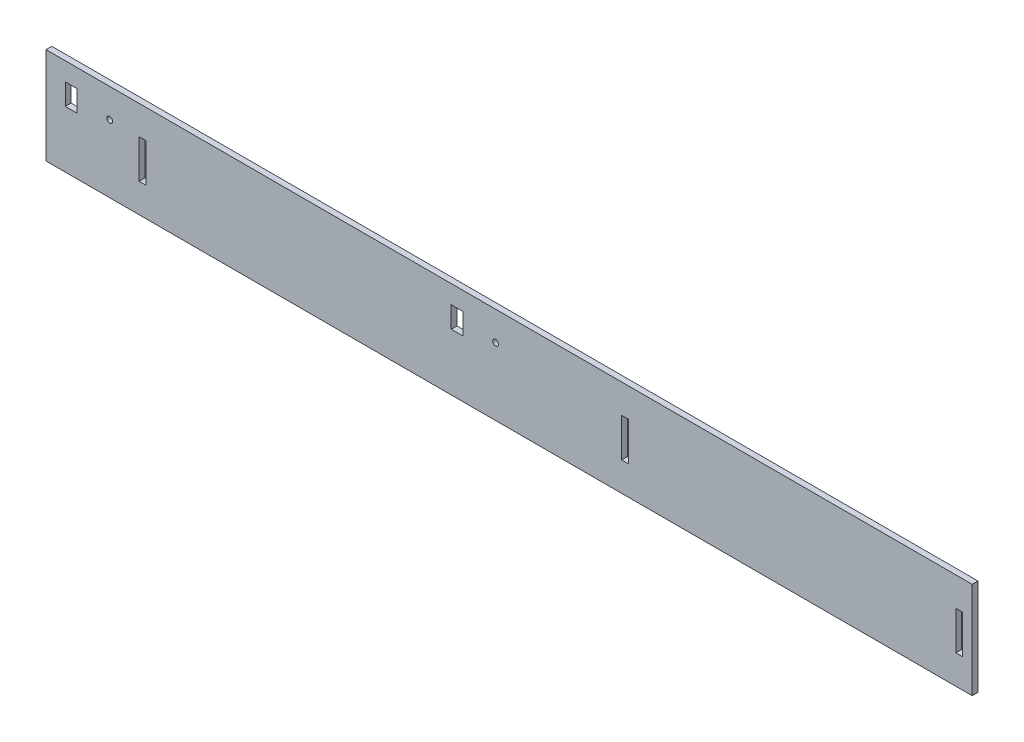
ISO-10303-21;
HEADER;
FILE_DESCRIPTION(('STEP AP214'),'2;1');
FILE_NAME('part.step','',(''),(''),'','','');
FILE_SCHEMA(('AUTOMOTIVE_DESIGN { 1 0 10303 214 1 1 1 1 }'));
ENDSEC;
DATA;
#1=APPLICATION_CONTEXT('core data for automotive mechanical design processes');
#2=APPLICATION_PROTOCOL_DEFINITION('international standard','automotive_design',2000,#1);
#3=PRODUCT_CONTEXT('',#1,'mechanical');
#4=PRODUCT('Part','Part','',(#3));
#5=PRODUCT_RELATED_PRODUCT_CATEGORY('part','',(#4));
#6=PRODUCT_DEFINITION_FORMATION('','',#4);
#7=PRODUCT_DEFINITION_CONTEXT('part definition',#1,'design');
#8=PRODUCT_DEFINITION('design','',#6,#7);
#9=PRODUCT_DEFINITION_SHAPE('','',#8);
#10=(LENGTH_UNIT() NAMED_UNIT(*) SI_UNIT(.MILLI.,.METRE.));
#11=(NAMED_UNIT(*) PLANE_ANGLE_UNIT() SI_UNIT($,.RADIAN.));
#12=(NAMED_UNIT(*) SI_UNIT($,.STERADIAN.) SOLID_ANGLE_UNIT());
#13=UNCERTAINTY_MEASURE_WITH_UNIT(LENGTH_MEASURE(1.E-05),#10,'distance_accuracy_value','');
#14=(GEOMETRIC_REPRESENTATION_CONTEXT(3) GLOBAL_UNCERTAINTY_ASSIGNED_CONTEXT((#13)) GLOBAL_UNIT_ASSIGNED_CONTEXT((#10,
#11,#12)) REPRESENTATION_CONTEXT('',''));
#15=CARTESIAN_POINT('',(0.,0.,0.));
#16=DIRECTION('',(0.,0.,1.));
#17=DIRECTION('',(1.,0.,0.));
#18=AXIS2_PLACEMENT_3D('',#15,#16,#17);
#19=CARTESIAN_POINT('',(0.,0.,3.));
#20=DIRECTION('',(0.,0.,1.));
#21=DIRECTION('',(1.,0.,0.));
#22=AXIS2_PLACEMENT_3D('',#19,#20,#21);
#23=PLANE('',#22);
#24=DIRECTION('',(1.,0.,0.));
#25=VECTOR('',#24,1.);
#26=CARTESIAN_POINT('',(210.,29.5,3.));
#27=LINE('',#26,#25);
#28=CARTESIAN_POINT('',(210.,29.5,3.));
#29=VERTEX_POINT('',#28);
#30=CARTESIAN_POINT('',(216.,29.5,3.));
#31=VERTEX_POINT('',#30);
#32=EDGE_CURVE('E269',#29,#31,#27,.T.);
#33=ORIENTED_EDGE('',*,*,#32,.F.);
#34=DIRECTION('',(0.,-1.,0.));
#35=VECTOR('',#34,1.);
#36=CARTESIAN_POINT('',(210.,40.5,3.));
#37=LINE('',#36,#35);
#38=CARTESIAN_POINT('',(210.,40.5,3.));
#39=VERTEX_POINT('',#38);
#40=EDGE_CURVE('E267',#39,#29,#37,.T.);
#41=ORIENTED_EDGE('',*,*,#40,.F.);
#42=DIRECTION('',(-1.,0.,0.));
#43=VECTOR('',#42,1.);
#44=CARTESIAN_POINT('',(210.,40.5,3.));
#45=LINE('',#44,#43);
#46=CARTESIAN_POINT('',(216.,40.5,3.));
#47=VERTEX_POINT('',#46);
#48=EDGE_CURVE('E275',#47,#39,#45,.T.);
#49=ORIENTED_EDGE('',*,*,#48,.F.);
#50=DIRECTION('',(0.,1.,0.));
#51=VECTOR('',#50,1.);
#52=CARTESIAN_POINT('',(216.,40.5,3.));
#53=LINE('',#52,#51);
#54=EDGE_CURVE('E272',#31,#47,#53,.T.);
#55=ORIENTED_EDGE('',*,*,#54,.F.);
#56=EDGE_LOOP('',(#33,#41,#49,#55));
#57=FACE_BOUND('',#56,.T.);
#58=DIRECTION('',(1.,0.,0.));
#59=VECTOR('',#58,1.);
#60=CARTESIAN_POINT('',(48.25,15.,3.));
#61=LINE('',#60,#59);
#62=CARTESIAN_POINT('',(48.25,15.,3.));
#63=VERTEX_POINT('',#62);
#64=CARTESIAN_POINT('',(51.75,15.,3.));
#65=VERTEX_POINT('',#64);
#66=EDGE_CURVE('E300',#63,#65,#61,.T.);
#67=ORIENTED_EDGE('',*,*,#66,.F.);
#68=DIRECTION('',(0.,-1.,0.));
#69=VECTOR('',#68,1.);
#70=CARTESIAN_POINT('',(48.25,35.,3.));
#71=LINE('',#70,#69);
#72=CARTESIAN_POINT('',(48.25,35.,3.));
#73=VERTEX_POINT('',#72);
#74=EDGE_CURVE('E298',#73,#63,#71,.T.);
#75=ORIENTED_EDGE('',*,*,#74,.F.);
#76=DIRECTION('',(-1.,0.,0.));
#77=VECTOR('',#76,1.);
#78=CARTESIAN_POINT('',(48.25,35.,3.));
#79=LINE('',#78,#77);
#80=CARTESIAN_POINT('',(51.75,35.,3.));
#81=VERTEX_POINT('',#80);
#82=EDGE_CURVE('E306',#81,#73,#79,.T.);
#83=ORIENTED_EDGE('',*,*,#82,.F.);
#84=DIRECTION('',(0.,1.,0.));
#85=VECTOR('',#84,1.);
#86=CARTESIAN_POINT('',(51.75,35.,3.));
#87=LINE('',#86,#85);
#88=EDGE_CURVE('E303',#65,#81,#87,.T.);
#89=ORIENTED_EDGE('',*,*,#88,.F.);
#90=EDGE_LOOP('',(#67,#75,#83,#89));
#91=FACE_BOUND('',#90,.T.);
#92=CARTESIAN_POINT('',(33.,35.,3.));
#93=DIRECTION('',(0.,0.,1.));
#94=DIRECTION('',(1.,0.,0.));
#95=AXIS2_PLACEMENT_3D('',#92,#93,#94);
#96=CIRCLE('',#95,1.5);
#97=CARTESIAN_POINT('',(34.5,35.,3.));
#98=VERTEX_POINT('',#97);
#99=EDGE_CURVE('E329',#98,#98,#96,.T.);
#100=ORIENTED_EDGE('',*,*,#99,.F.);
#101=EDGE_LOOP('',(#100));
#102=FACE_BOUND('',#101,.T.);
#103=DIRECTION('',(0.,-1.,0.));
#104=VECTOR('',#103,1.);
#105=CARTESIAN_POINT('',(0.,50.,3.));
#106=LINE('',#105,#104);
#107=CARTESIAN_POINT('',(0.,50.,3.));
#108=VERTEX_POINT('',#107);
#109=CARTESIAN_POINT('',(0.,0.,3.));
#110=VERTEX_POINT('',#109);
#111=EDGE_CURVE('E366',#108,#110,#106,.T.);
#112=ORIENTED_EDGE('',*,*,#111,.T.);
#113=DIRECTION('',(1.,0.,0.));
#114=VECTOR('',#113,1.);
#115=CARTESIAN_POINT('',(0.,0.,3.));
#116=LINE('',#115,#114);
#117=CARTESIAN_POINT('',(480.,0.,3.));
#118=VERTEX_POINT('',#117);
#119=EDGE_CURVE('E369',#110,#118,#116,.T.);
#120=ORIENTED_EDGE('',*,*,#119,.T.);
#121=DIRECTION('',(0.,1.,0.));
#122=VECTOR('',#121,1.);
#123=CARTESIAN_POINT('',(480.,50.,3.));
#124=LINE('',#123,#122);
#125=CARTESIAN_POINT('',(480.,50.,3.));
#126=VERTEX_POINT('',#125);
#127=EDGE_CURVE('E372',#118,#126,#124,.T.);
#128=ORIENTED_EDGE('',*,*,#127,.T.);
#129=DIRECTION('',(-1.,0.,0.));
#130=VECTOR('',#129,1.);
#131=CARTESIAN_POINT('',(0.,50.,3.));
#132=LINE('',#131,#130);
#133=EDGE_CURVE('E374',#126,#108,#132,.T.);
#134=ORIENTED_EDGE('',*,*,#133,.T.);
#135=EDGE_LOOP('',(#112,#120,#128,#134));
#136=FACE_BOUND('',#135,.T.);
#137=DIRECTION('',(1.,0.,0.));
#138=VECTOR('',#137,1.);
#139=CARTESIAN_POINT('',(10.,29.5,3.));
#140=LINE('',#139,#138);
#141=CARTESIAN_POINT('',(10.,29.5,3.));
#142=VERTEX_POINT('',#141);
#143=CARTESIAN_POINT('',(16.,29.5,3.));
#144=VERTEX_POINT('',#143);
#145=EDGE_CURVE('E337',#142,#144,#140,.T.);
#146=ORIENTED_EDGE('',*,*,#145,.F.);
#147=DIRECTION('',(0.,-1.,0.));
#148=VECTOR('',#147,1.);
#149=CARTESIAN_POINT('',(10.,40.5,3.));
#150=LINE('',#149,#148);
#151=CARTESIAN_POINT('',(10.,40.5,3.));
#152=VERTEX_POINT('',#151);
#153=EDGE_CURVE('E335',#152,#142,#150,.T.);
#154=ORIENTED_EDGE('',*,*,#153,.F.);
#155=DIRECTION('',(-1.,0.,0.));
#156=VECTOR('',#155,1.);
#157=CARTESIAN_POINT('',(10.,40.5,3.));
#158=LINE('',#157,#156);
#159=CARTESIAN_POINT('',(16.,40.5,3.));
#160=VERTEX_POINT('',#159);
#161=EDGE_CURVE('E343',#160,#152,#158,.T.);
#162=ORIENTED_EDGE('',*,*,#161,.F.);
#163=DIRECTION('',(0.,1.,0.));
#164=VECTOR('',#163,1.);
#165=CARTESIAN_POINT('',(16.,40.5,3.));
#166=LINE('',#165,#164);
#167=EDGE_CURVE('E340',#144,#160,#166,.T.);
#168=ORIENTED_EDGE('',*,*,#167,.F.);
#169=EDGE_LOOP('',(#146,#154,#162,#168));
#170=FACE_BOUND('',#169,.T.);
#171=CARTESIAN_POINT('',(233.,35.,3.));
#172=DIRECTION('',(0.,0.,1.));
#173=DIRECTION('',(1.,0.,0.));
#174=AXIS2_PLACEMENT_3D('',#171,#172,#173);
#175=CIRCLE('',#174,1.5);
#176=CARTESIAN_POINT('',(234.5,35.,3.));
#177=VERTEX_POINT('',#176);
#178=EDGE_CURVE('E261',#177,#177,#175,.T.);
#179=ORIENTED_EDGE('',*,*,#178,.F.);
#180=EDGE_LOOP('',(#179));
#181=FACE_BOUND('',#180,.T.);
#182=DIRECTION('',(1.,0.,0.));
#183=VECTOR('',#182,1.);
#184=CARTESIAN_POINT('',(298.25,15.,3.));
#185=LINE('',#184,#183);
#186=CARTESIAN_POINT('',(298.25,15.,3.));
#187=VERTEX_POINT('',#186);
#188=CARTESIAN_POINT('',(301.75,15.,3.));
#189=VERTEX_POINT('',#188);
#190=EDGE_CURVE('E232',#187,#189,#185,.T.);
#191=ORIENTED_EDGE('',*,*,#190,.F.);
#192=DIRECTION('',(0.,-1.,0.));
#193=VECTOR('',#192,1.);
#194=CARTESIAN_POINT('',(298.25,35.,3.));
#195=LINE('',#194,#193);
#196=CARTESIAN_POINT('',(298.25,35.,3.));
#197=VERTEX_POINT('',#196);
#198=EDGE_CURVE('E230',#197,#187,#195,.T.);
#199=ORIENTED_EDGE('',*,*,#198,.F.);
#200=DIRECTION('',(-1.,0.,0.));
#201=VECTOR('',#200,1.);
#202=CARTESIAN_POINT('',(298.25,35.,3.));
#203=LINE('',#202,#201);
#204=CARTESIAN_POINT('',(301.75,35.,3.));
#205=VERTEX_POINT('',#204);
#206=EDGE_CURVE('E238',#205,#197,#203,.T.);
#207=ORIENTED_EDGE('',*,*,#206,.F.);
#208=DIRECTION('',(0.,1.,0.));
#209=VECTOR('',#208,1.);
#210=CARTESIAN_POINT('',(301.75,35.,3.));
#211=LINE('',#210,#209);
#212=EDGE_CURVE('E235',#189,#205,#211,.T.);
#213=ORIENTED_EDGE('',*,*,#212,.F.);
#214=EDGE_LOOP('',(#191,#199,#207,#213));
#215=FACE_BOUND('',#214,.T.);
#216=DIRECTION('',(1.,0.,0.));
#217=VECTOR('',#216,1.);
#218=CARTESIAN_POINT('',(471.5,15.,3.));
#219=LINE('',#218,#217);
#220=CARTESIAN_POINT('',(471.5,15.,3.));
#221=VERTEX_POINT('',#220);
#222=CARTESIAN_POINT('',(475.,15.,3.));
#223=VERTEX_POINT('',#222);
#224=EDGE_CURVE('E202',#221,#223,#219,.T.);
#225=ORIENTED_EDGE('',*,*,#224,.F.);
#226=DIRECTION('',(0.,-1.,0.));
#227=VECTOR('',#226,1.);
#228=CARTESIAN_POINT('',(471.5,35.,3.));
#229=LINE('',#228,#227);
#230=CARTESIAN_POINT('',(471.5,35.,3.));
#231=VERTEX_POINT('',#230);
#232=EDGE_CURVE('E194',#231,#221,#229,.T.);
#233=ORIENTED_EDGE('',*,*,#232,.F.);
#234=DIRECTION('',(-1.,0.,0.));
#235=VECTOR('',#234,1.);
#236=CARTESIAN_POINT('',(471.5,35.,3.));
#237=LINE('',#236,#235);
#238=CARTESIAN_POINT('',(475.,35.,3.));
#239=VERTEX_POINT('',#238);
#240=EDGE_CURVE('E216',#239,#231,#237,.T.);
#241=ORIENTED_EDGE('',*,*,#240,.F.);
#242=DIRECTION('',(0.,1.,0.));
#243=VECTOR('',#242,1.);
#244=CARTESIAN_POINT('',(475.,35.,3.));
#245=LINE('',#244,#243);
#246=EDGE_CURVE('E214',#223,#239,#245,.T.);
#247=ORIENTED_EDGE('',*,*,#246,.F.);
#248=EDGE_LOOP('',(#225,#233,#241,#247));
#249=FACE_BOUND('',#248,.T.);
#250=ADVANCED_FACE('F33',(#57,#91,#102,#136,#170,#181,#215,#249),#23,.T.);
#251=CARTESIAN_POINT('',(0.,0.,0.));
#252=DIRECTION('',(0.,0.,1.));
#253=DIRECTION('',(1.,0.,0.));
#254=AXIS2_PLACEMENT_3D('',#251,#252,#253);
#255=PLANE('',#254);
#256=DIRECTION('',(0.,-1.,0.));
#257=VECTOR('',#256,1.);
#258=CARTESIAN_POINT('',(298.25,35.,0.));
#259=LINE('',#258,#257);
#260=CARTESIAN_POINT('',(298.25,35.,0.));
#261=VERTEX_POINT('',#260);
#262=CARTESIAN_POINT('',(298.25,15.,0.));
#263=VERTEX_POINT('',#262);
#264=EDGE_CURVE('E210',#261,#263,#259,.T.);
#265=ORIENTED_EDGE('',*,*,#264,.T.);
#266=DIRECTION('',(1.,0.,0.));
#267=VECTOR('',#266,1.);
#268=CARTESIAN_POINT('',(298.25,15.,0.));
#269=LINE('',#268,#267);
#270=CARTESIAN_POINT('',(301.75,15.,0.));
#271=VERTEX_POINT('',#270);
#272=EDGE_CURVE('E243',#263,#271,#269,.T.);
#273=ORIENTED_EDGE('',*,*,#272,.T.);
#274=DIRECTION('',(0.,1.,0.));
#275=VECTOR('',#274,1.);
#276=CARTESIAN_POINT('',(301.75,35.,0.));
#277=LINE('',#276,#275);
#278=CARTESIAN_POINT('',(301.75,35.,0.));
#279=VERTEX_POINT('',#278);
#280=EDGE_CURVE('E246',#271,#279,#277,.T.);
#281=ORIENTED_EDGE('',*,*,#280,.T.);
#282=DIRECTION('',(-1.,0.,0.));
#283=VECTOR('',#282,1.);
#284=CARTESIAN_POINT('',(298.25,35.,0.));
#285=LINE('',#284,#283);
#286=EDGE_CURVE('E233',#279,#261,#285,.T.);
#287=ORIENTED_EDGE('',*,*,#286,.T.);
#288=EDGE_LOOP('',(#265,#273,#281,#287));
#289=FACE_BOUND('',#288,.T.);
#290=DIRECTION('',(0.,-1.,0.));
#291=VECTOR('',#290,1.);
#292=CARTESIAN_POINT('',(48.25,35.,0.));
#293=LINE('',#292,#291);
#294=CARTESIAN_POINT('',(48.25,35.,0.));
#295=VERTEX_POINT('',#294);
#296=CARTESIAN_POINT('',(48.25,15.,0.));
#297=VERTEX_POINT('',#296);
#298=EDGE_CURVE('E297',#295,#297,#293,.T.);
#299=ORIENTED_EDGE('',*,*,#298,.T.);
#300=DIRECTION('',(1.,0.,0.));
#301=VECTOR('',#300,1.);
#302=CARTESIAN_POINT('',(48.25,15.,0.));
#303=LINE('',#302,#301);
#304=CARTESIAN_POINT('',(51.75,15.,0.));
#305=VERTEX_POINT('',#304);
#306=EDGE_CURVE('E311',#297,#305,#303,.T.);
#307=ORIENTED_EDGE('',*,*,#306,.T.);
#308=DIRECTION('',(0.,1.,0.));
#309=VECTOR('',#308,1.);
#310=CARTESIAN_POINT('',(51.75,35.,0.));
#311=LINE('',#310,#309);
#312=CARTESIAN_POINT('',(51.75,35.,0.));
#313=VERTEX_POINT('',#312);
#314=EDGE_CURVE('E314',#305,#313,#311,.T.);
#315=ORIENTED_EDGE('',*,*,#314,.T.);
#316=DIRECTION('',(-1.,0.,0.));
#317=VECTOR('',#316,1.);
#318=CARTESIAN_POINT('',(48.25,35.,0.));
#319=LINE('',#318,#317);
#320=EDGE_CURVE('E301',#313,#295,#319,.T.);
#321=ORIENTED_EDGE('',*,*,#320,.T.);
#322=EDGE_LOOP('',(#299,#307,#315,#321));
#323=FACE_BOUND('',#322,.T.);
#324=DIRECTION('',(0.,-1.,0.));
#325=VECTOR('',#324,1.);
#326=CARTESIAN_POINT('',(0.,50.,0.));
#327=LINE('',#326,#325);
#328=CARTESIAN_POINT('',(0.,50.,0.));
#329=VERTEX_POINT('',#328);
#330=CARTESIAN_POINT('',(0.,0.,0.));
#331=VERTEX_POINT('',#330);
#332=EDGE_CURVE('E365',#329,#331,#327,.T.);
#333=ORIENTED_EDGE('',*,*,#332,.F.);
#334=DIRECTION('',(-1.,0.,0.));
#335=VECTOR('',#334,1.);
#336=CARTESIAN_POINT('',(0.,50.,0.));
#337=LINE('',#336,#335);
#338=CARTESIAN_POINT('',(480.,50.,0.));
#339=VERTEX_POINT('',#338);
#340=EDGE_CURVE('E370',#339,#329,#337,.T.);
#341=ORIENTED_EDGE('',*,*,#340,.F.);
#342=DIRECTION('',(0.,1.,0.));
#343=VECTOR('',#342,1.);
#344=CARTESIAN_POINT('',(480.,50.,0.));
#345=LINE('',#344,#343);
#346=CARTESIAN_POINT('',(480.,0.,0.));
#347=VERTEX_POINT('',#346);
#348=EDGE_CURVE('E381',#347,#339,#345,.T.);
#349=ORIENTED_EDGE('',*,*,#348,.F.);
#350=DIRECTION('',(1.,0.,0.));
#351=VECTOR('',#350,1.);
#352=CARTESIAN_POINT('',(0.,0.,0.));
#353=LINE('',#352,#351);
#354=EDGE_CURVE('E379',#331,#347,#353,.T.);
#355=ORIENTED_EDGE('',*,*,#354,.F.);
#356=EDGE_LOOP('',(#333,#341,#349,#355));
#357=FACE_BOUND('',#356,.T.);
#358=DIRECTION('',(0.,-1.,0.));
#359=VECTOR('',#358,1.);
#360=CARTESIAN_POINT('',(10.,40.5,0.));
#361=LINE('',#360,#359);
#362=CARTESIAN_POINT('',(10.,40.5,0.));
#363=VERTEX_POINT('',#362);
#364=CARTESIAN_POINT('',(10.,29.5,0.));
#365=VERTEX_POINT('',#364);
#366=EDGE_CURVE('E332',#363,#365,#361,.T.);
#367=ORIENTED_EDGE('',*,*,#366,.T.);
#368=DIRECTION('',(1.,0.,0.));
#369=VECTOR('',#368,1.);
#370=CARTESIAN_POINT('',(10.,29.5,0.));
#371=LINE('',#370,#369);
#372=CARTESIAN_POINT('',(16.,29.5,0.));
#373=VERTEX_POINT('',#372);
#374=EDGE_CURVE('E348',#365,#373,#371,.T.);
#375=ORIENTED_EDGE('',*,*,#374,.T.);
#376=DIRECTION('',(0.,1.,0.));
#377=VECTOR('',#376,1.);
#378=CARTESIAN_POINT('',(16.,40.5,0.));
#379=LINE('',#378,#377);
#380=CARTESIAN_POINT('',(16.,40.5,0.));
#381=VERTEX_POINT('',#380);
#382=EDGE_CURVE('E351',#373,#381,#379,.T.);
#383=ORIENTED_EDGE('',*,*,#382,.T.);
#384=DIRECTION('',(-1.,0.,0.));
#385=VECTOR('',#384,1.);
#386=CARTESIAN_POINT('',(10.,40.5,0.));
#387=LINE('',#386,#385);
#388=EDGE_CURVE('E338',#381,#363,#387,.T.);
#389=ORIENTED_EDGE('',*,*,#388,.T.);
#390=EDGE_LOOP('',(#367,#375,#383,#389));
#391=FACE_BOUND('',#390,.T.);
#392=CARTESIAN_POINT('',(33.,35.,0.));
#393=DIRECTION('',(0.,0.,1.));
#394=DIRECTION('',(1.,0.,0.));
#395=AXIS2_PLACEMENT_3D('',#392,#393,#394);
#396=CIRCLE('',#395,1.5);
#397=CARTESIAN_POINT('',(34.5,35.,0.));
#398=VERTEX_POINT('',#397);
#399=EDGE_CURVE('E328',#398,#398,#396,.T.);
#400=ORIENTED_EDGE('',*,*,#399,.T.);
#401=EDGE_LOOP('',(#400));
#402=FACE_BOUND('',#401,.T.);
#403=DIRECTION('',(0.,-1.,0.));
#404=VECTOR('',#403,1.);
#405=CARTESIAN_POINT('',(210.,40.5,0.));
#406=LINE('',#405,#404);
#407=CARTESIAN_POINT('',(210.,40.5,0.));
#408=VERTEX_POINT('',#407);
#409=CARTESIAN_POINT('',(210.,29.5,0.));
#410=VERTEX_POINT('',#409);
#411=EDGE_CURVE('E264',#408,#410,#406,.T.);
#412=ORIENTED_EDGE('',*,*,#411,.T.);
#413=DIRECTION('',(1.,0.,0.));
#414=VECTOR('',#413,1.);
#415=CARTESIAN_POINT('',(210.,29.5,0.));
#416=LINE('',#415,#414);
#417=CARTESIAN_POINT('',(216.,29.5,0.));
#418=VERTEX_POINT('',#417);
#419=EDGE_CURVE('E280',#410,#418,#416,.T.);
#420=ORIENTED_EDGE('',*,*,#419,.T.);
#421=DIRECTION('',(0.,1.,0.));
#422=VECTOR('',#421,1.);
#423=CARTESIAN_POINT('',(216.,40.5,0.));
#424=LINE('',#423,#422);
#425=CARTESIAN_POINT('',(216.,40.5,0.));
#426=VERTEX_POINT('',#425);
#427=EDGE_CURVE('E283',#418,#426,#424,.T.);
#428=ORIENTED_EDGE('',*,*,#427,.T.);
#429=DIRECTION('',(-1.,0.,0.));
#430=VECTOR('',#429,1.);
#431=CARTESIAN_POINT('',(210.,40.5,0.));
#432=LINE('',#431,#430);
#433=EDGE_CURVE('E270',#426,#408,#432,.T.);
#434=ORIENTED_EDGE('',*,*,#433,.T.);
#435=EDGE_LOOP('',(#412,#420,#428,#434));
#436=FACE_BOUND('',#435,.T.);
#437=CARTESIAN_POINT('',(233.,35.,0.));
#438=DIRECTION('',(0.,0.,1.));
#439=DIRECTION('',(1.,0.,0.));
#440=AXIS2_PLACEMENT_3D('',#437,#438,#439);
#441=CIRCLE('',#440,1.5);
#442=CARTESIAN_POINT('',(234.5,35.,0.));
#443=VERTEX_POINT('',#442);
#444=EDGE_CURVE('E260',#443,#443,#441,.T.);
#445=ORIENTED_EDGE('',*,*,#444,.T.);
#446=EDGE_LOOP('',(#445));
#447=FACE_BOUND('',#446,.T.);
#448=DIRECTION('',(0.,-1.,0.));
#449=VECTOR('',#448,1.);
#450=CARTESIAN_POINT('',(471.5,35.,0.));
#451=LINE('',#450,#449);
#452=CARTESIAN_POINT('',(471.5,35.,0.));
#453=VERTEX_POINT('',#452);
#454=CARTESIAN_POINT('',(471.5,15.,0.));
#455=VERTEX_POINT('',#454);
#456=EDGE_CURVE('E56',#453,#455,#451,.T.);
#457=ORIENTED_EDGE('',*,*,#456,.T.);
#458=DIRECTION('',(1.,0.,0.));
#459=VECTOR('',#458,1.);
#460=CARTESIAN_POINT('',(471.5,15.,0.));
#461=LINE('',#460,#459);
#462=CARTESIAN_POINT('',(475.,15.,0.));
#463=VERTEX_POINT('',#462);
#464=EDGE_CURVE('E209',#455,#463,#461,.T.);
#465=ORIENTED_EDGE('',*,*,#464,.T.);
#466=DIRECTION('',(0.,1.,0.));
#467=VECTOR('',#466,1.);
#468=CARTESIAN_POINT('',(475.,35.,0.));
#469=LINE('',#468,#467);
#470=CARTESIAN_POINT('',(475.,35.,0.));
#471=VERTEX_POINT('',#470);
#472=EDGE_CURVE('E222',#463,#471,#469,.T.);
#473=ORIENTED_EDGE('',*,*,#472,.T.);
#474=DIRECTION('',(-1.,0.,0.));
#475=VECTOR('',#474,1.);
#476=CARTESIAN_POINT('',(471.5,35.,0.));
#477=LINE('',#476,#475);
#478=EDGE_CURVE('E203',#471,#453,#477,.T.);
#479=ORIENTED_EDGE('',*,*,#478,.T.);
#480=EDGE_LOOP('',(#457,#465,#473,#479));
#481=FACE_BOUND('',#480,.T.);
#482=ADVANCED_FACE('F399',(#289,#323,#357,#391,#402,#436,#447,#481),#255,.F.);
#483=CARTESIAN_POINT('',(0.,50.,3.));
#484=DIRECTION('',(1.,0.,0.));
#485=DIRECTION('',(0.,0.,-1.));
#486=AXIS2_PLACEMENT_3D('',#483,#484,#485);
#487=PLANE('',#486);
#488=ORIENTED_EDGE('',*,*,#332,.T.);
#489=DIRECTION('',(0.,0.,-1.));
#490=VECTOR('',#489,1.);
#491=CARTESIAN_POINT('',(0.,0.,3.));
#492=LINE('',#491,#490);
#493=EDGE_CURVE('E11',#110,#331,#492,.T.);
#494=ORIENTED_EDGE('',*,*,#493,.F.);
#495=ORIENTED_EDGE('',*,*,#111,.F.);
#496=DIRECTION('',(0.,0.,-1.));
#497=VECTOR('',#496,1.);
#498=CARTESIAN_POINT('',(0.,50.,3.));
#499=LINE('',#498,#497);
#500=EDGE_CURVE('E376',#108,#329,#499,.T.);
#501=ORIENTED_EDGE('',*,*,#500,.T.);
#502=EDGE_LOOP('',(#488,#494,#495,#501));
#503=FACE_BOUND('',#502,.T.);
#504=ADVANCED_FACE('F35',(#503),#487,.F.);
#505=CARTESIAN_POINT('',(0.,0.,3.));
#506=DIRECTION('',(0.,1.,0.));
#507=DIRECTION('',(0.,0.,1.));
#508=AXIS2_PLACEMENT_3D('',#505,#506,#507);
#509=PLANE('',#508);
#510=ORIENTED_EDGE('',*,*,#354,.T.);
#511=DIRECTION('',(0.,0.,-1.));
#512=VECTOR('',#511,1.);
#513=CARTESIAN_POINT('',(480.,0.,3.));
#514=LINE('',#513,#512);
#515=EDGE_CURVE('E41',#118,#347,#514,.T.);
#516=ORIENTED_EDGE('',*,*,#515,.F.);
#517=ORIENTED_EDGE('',*,*,#119,.F.);
#518=ORIENTED_EDGE('',*,*,#493,.T.);
#519=EDGE_LOOP('',(#510,#516,#517,#518));
#520=FACE_BOUND('',#519,.T.);
#521=ADVANCED_FACE('F410',(#520),#509,.F.);
#522=CARTESIAN_POINT('',(480.,50.,3.));
#523=DIRECTION('',(-1.,0.,0.));
#524=DIRECTION('',(0.,0.,1.));
#525=AXIS2_PLACEMENT_3D('',#522,#523,#524);
#526=PLANE('',#525);
#527=ORIENTED_EDGE('',*,*,#348,.T.);
#528=DIRECTION('',(0.,0.,-1.));
#529=VECTOR('',#528,1.);
#530=CARTESIAN_POINT('',(480.,50.,3.));
#531=LINE('',#530,#529);
#532=EDGE_CURVE('E386',#126,#339,#531,.T.);
#533=ORIENTED_EDGE('',*,*,#532,.F.);
#534=ORIENTED_EDGE('',*,*,#127,.F.);
#535=ORIENTED_EDGE('',*,*,#515,.T.);
#536=EDGE_LOOP('',(#527,#533,#534,#535));
#537=FACE_BOUND('',#536,.T.);
#538=ADVANCED_FACE('F393',(#537),#526,.F.);
#539=CARTESIAN_POINT('',(0.,50.,3.));
#540=DIRECTION('',(0.,-1.,0.));
#541=DIRECTION('',(1.,0.,0.));
#542=AXIS2_PLACEMENT_3D('',#539,#540,#541);
#543=PLANE('',#542);
#544=ORIENTED_EDGE('',*,*,#340,.T.);
#545=ORIENTED_EDGE('',*,*,#500,.F.);
#546=ORIENTED_EDGE('',*,*,#133,.F.);
#547=ORIENTED_EDGE('',*,*,#532,.T.);
#548=EDGE_LOOP('',(#544,#545,#546,#547));
#549=FACE_BOUND('',#548,.T.);
#550=ADVANCED_FACE('F403',(#549),#543,.F.);
#551=CARTESIAN_POINT('',(10.,40.5,3.));
#552=DIRECTION('',(1.,0.,0.));
#553=DIRECTION('',(0.,0.,-1.));
#554=AXIS2_PLACEMENT_3D('',#551,#552,#553);
#555=PLANE('',#554);
#556=ORIENTED_EDGE('',*,*,#366,.F.);
#557=DIRECTION('',(0.,0.,-1.));
#558=VECTOR('',#557,1.);
#559=CARTESIAN_POINT('',(10.,40.5,3.));
#560=LINE('',#559,#558);
#561=EDGE_CURVE('E345',#152,#363,#560,.T.);
#562=ORIENTED_EDGE('',*,*,#561,.F.);
#563=ORIENTED_EDGE('',*,*,#153,.T.);
#564=DIRECTION('',(0.,0.,-1.));
#565=VECTOR('',#564,1.);
#566=CARTESIAN_POINT('',(10.,29.5,3.));
#567=LINE('',#566,#565);
#568=EDGE_CURVE('E362',#142,#365,#567,.T.);
#569=ORIENTED_EDGE('',*,*,#568,.T.);
#570=EDGE_LOOP('',(#556,#562,#563,#569));
#571=FACE_BOUND('',#570,.T.);
#572=ADVANCED_FACE('F428',(#571),#555,.T.);
#573=CARTESIAN_POINT('',(10.,29.5,3.));
#574=DIRECTION('',(0.,1.,0.));
#575=DIRECTION('',(0.,0.,1.));
#576=AXIS2_PLACEMENT_3D('',#573,#574,#575);
#577=PLANE('',#576);
#578=ORIENTED_EDGE('',*,*,#374,.F.);
#579=ORIENTED_EDGE('',*,*,#568,.F.);
#580=ORIENTED_EDGE('',*,*,#145,.T.);
#581=DIRECTION('',(0.,0.,-1.));
#582=VECTOR('',#581,1.);
#583=CARTESIAN_POINT('',(16.,29.5,3.));
#584=LINE('',#583,#582);
#585=EDGE_CURVE('E360',#144,#373,#584,.T.);
#586=ORIENTED_EDGE('',*,*,#585,.T.);
#587=EDGE_LOOP('',(#578,#579,#580,#586));
#588=FACE_BOUND('',#587,.T.);
#589=ADVANCED_FACE('F435',(#588),#577,.T.);
#590=CARTESIAN_POINT('',(16.,40.5,3.));
#591=DIRECTION('',(-1.,0.,0.));
#592=DIRECTION('',(0.,0.,1.));
#593=AXIS2_PLACEMENT_3D('',#590,#591,#592);
#594=PLANE('',#593);
#595=ORIENTED_EDGE('',*,*,#382,.F.);
#596=ORIENTED_EDGE('',*,*,#585,.F.);
#597=ORIENTED_EDGE('',*,*,#167,.T.);
#598=DIRECTION('',(0.,0.,-1.));
#599=VECTOR('',#598,1.);
#600=CARTESIAN_POINT('',(16.,40.5,3.));
#601=LINE('',#600,#599);
#602=EDGE_CURVE('E358',#160,#381,#601,.T.);
#603=ORIENTED_EDGE('',*,*,#602,.T.);
#604=EDGE_LOOP('',(#595,#596,#597,#603));
#605=FACE_BOUND('',#604,.T.);
#606=ADVANCED_FACE('F440',(#605),#594,.T.);
#607=CARTESIAN_POINT('',(10.,40.5,3.));
#608=DIRECTION('',(0.,-1.,0.));
#609=DIRECTION('',(0.,0.,-1.));
#610=AXIS2_PLACEMENT_3D('',#607,#608,#609);
#611=PLANE('',#610);
#612=ORIENTED_EDGE('',*,*,#388,.F.);
#613=ORIENTED_EDGE('',*,*,#602,.F.);
#614=ORIENTED_EDGE('',*,*,#161,.T.);
#615=ORIENTED_EDGE('',*,*,#561,.T.);
#616=EDGE_LOOP('',(#612,#613,#614,#615));
#617=FACE_BOUND('',#616,.T.);
#618=ADVANCED_FACE('F447',(#617),#611,.T.);
#619=CARTESIAN_POINT('',(33.,35.,3.));
#620=DIRECTION('',(0.,0.,-1.));
#621=DIRECTION('',(-1.,0.,0.));
#622=AXIS2_PLACEMENT_3D('',#619,#620,#621);
#623=CYLINDRICAL_SURFACE('',#622,1.5);
#624=ORIENTED_EDGE('',*,*,#99,.T.);
#625=EDGE_LOOP('',(#624));
#626=FACE_BOUND('',#625,.T.);
#627=ORIENTED_EDGE('',*,*,#399,.F.);
#628=EDGE_LOOP('',(#627));
#629=FACE_BOUND('',#628,.T.);
#630=ADVANCED_FACE('F525',(#626,#629),#623,.F.);
#631=CARTESIAN_POINT('',(48.25,35.,3.));
#632=DIRECTION('',(1.,0.,0.));
#633=DIRECTION('',(0.,0.,-1.));
#634=AXIS2_PLACEMENT_3D('',#631,#632,#633);
#635=PLANE('',#634);
#636=ORIENTED_EDGE('',*,*,#298,.F.);
#637=DIRECTION('',(0.,0.,-1.));
#638=VECTOR('',#637,1.);
#639=CARTESIAN_POINT('',(48.25,35.,3.));
#640=LINE('',#639,#638);
#641=EDGE_CURVE('E308',#73,#295,#640,.T.);
#642=ORIENTED_EDGE('',*,*,#641,.F.);
#643=ORIENTED_EDGE('',*,*,#74,.T.);
#644=DIRECTION('',(0.,0.,-1.));
#645=VECTOR('',#644,1.);
#646=CARTESIAN_POINT('',(48.25,15.,3.));
#647=LINE('',#646,#645);
#648=EDGE_CURVE('E325',#63,#297,#647,.T.);
#649=ORIENTED_EDGE('',*,*,#648,.T.);
#650=EDGE_LOOP('',(#636,#642,#643,#649));
#651=FACE_BOUND('',#650,.T.);
#652=ADVANCED_FACE('F521',(#651),#635,.T.);
#653=CARTESIAN_POINT('',(48.25,15.,3.));
#654=DIRECTION('',(0.,1.,0.));
#655=DIRECTION('',(0.,0.,1.));
#656=AXIS2_PLACEMENT_3D('',#653,#654,#655);
#657=PLANE('',#656);
#658=ORIENTED_EDGE('',*,*,#306,.F.);
#659=ORIENTED_EDGE('',*,*,#648,.F.);
#660=ORIENTED_EDGE('',*,*,#66,.T.);
#661=DIRECTION('',(0.,0.,-1.));
#662=VECTOR('',#661,1.);
#663=CARTESIAN_POINT('',(51.75,15.,3.));
#664=LINE('',#663,#662);
#665=EDGE_CURVE('E323',#65,#305,#664,.T.);
#666=ORIENTED_EDGE('',*,*,#665,.T.);
#667=EDGE_LOOP('',(#658,#659,#660,#666));
#668=FACE_BOUND('',#667,.T.);
#669=ADVANCED_FACE('F517',(#668),#657,.T.);
#670=CARTESIAN_POINT('',(51.75,35.,3.));
#671=DIRECTION('',(-1.,0.,0.));
#672=DIRECTION('',(0.,-1.,0.));
#673=AXIS2_PLACEMENT_3D('',#670,#671,#672);
#674=PLANE('',#673);
#675=ORIENTED_EDGE('',*,*,#314,.F.);
#676=ORIENTED_EDGE('',*,*,#665,.F.);
#677=ORIENTED_EDGE('',*,*,#88,.T.);
#678=DIRECTION('',(0.,0.,-1.));
#679=VECTOR('',#678,1.);
#680=CARTESIAN_POINT('',(51.75,35.,3.));
#681=LINE('',#680,#679);
#682=EDGE_CURVE('E321',#81,#313,#681,.T.);
#683=ORIENTED_EDGE('',*,*,#682,.T.);
#684=EDGE_LOOP('',(#675,#676,#677,#683));
#685=FACE_BOUND('',#684,.T.);
#686=ADVANCED_FACE('F513',(#685),#674,.T.);
#687=CARTESIAN_POINT('',(48.25,35.,3.));
#688=DIRECTION('',(0.,-1.,0.));
#689=DIRECTION('',(0.,0.,-1.));
#690=AXIS2_PLACEMENT_3D('',#687,#688,#689);
#691=PLANE('',#690);
#692=ORIENTED_EDGE('',*,*,#320,.F.);
#693=ORIENTED_EDGE('',*,*,#682,.F.);
#694=ORIENTED_EDGE('',*,*,#82,.T.);
#695=ORIENTED_EDGE('',*,*,#641,.T.);
#696=EDGE_LOOP('',(#692,#693,#694,#695));
#697=FACE_BOUND('',#696,.T.);
#698=ADVANCED_FACE('F509',(#697),#691,.T.);
#699=CARTESIAN_POINT('',(210.,40.5,3.));
#700=DIRECTION('',(1.,0.,0.));
#701=DIRECTION('',(0.,0.,-1.));
#702=AXIS2_PLACEMENT_3D('',#699,#700,#701);
#703=PLANE('',#702);
#704=ORIENTED_EDGE('',*,*,#411,.F.);
#705=DIRECTION('',(0.,0.,-1.));
#706=VECTOR('',#705,1.);
#707=CARTESIAN_POINT('',(210.,40.5,3.));
#708=LINE('',#707,#706);
#709=EDGE_CURVE('E277',#39,#408,#708,.T.);
#710=ORIENTED_EDGE('',*,*,#709,.F.);
#711=ORIENTED_EDGE('',*,*,#40,.T.);
#712=DIRECTION('',(0.,0.,-1.));
#713=VECTOR('',#712,1.);
#714=CARTESIAN_POINT('',(210.,29.5,3.));
#715=LINE('',#714,#713);
#716=EDGE_CURVE('E294',#29,#410,#715,.T.);
#717=ORIENTED_EDGE('',*,*,#716,.T.);
#718=EDGE_LOOP('',(#704,#710,#711,#717));
#719=FACE_BOUND('',#718,.T.);
#720=ADVANCED_FACE('F505',(#719),#703,.T.);
#721=CARTESIAN_POINT('',(210.,29.5,3.));
#722=DIRECTION('',(0.,1.,0.));
#723=DIRECTION('',(0.,0.,1.));
#724=AXIS2_PLACEMENT_3D('',#721,#722,#723);
#725=PLANE('',#724);
#726=ORIENTED_EDGE('',*,*,#419,.F.);
#727=ORIENTED_EDGE('',*,*,#716,.F.);
#728=ORIENTED_EDGE('',*,*,#32,.T.);
#729=DIRECTION('',(0.,0.,-1.));
#730=VECTOR('',#729,1.);
#731=CARTESIAN_POINT('',(216.,29.5,3.));
#732=LINE('',#731,#730);
#733=EDGE_CURVE('E292',#31,#418,#732,.T.);
#734=ORIENTED_EDGE('',*,*,#733,.T.);
#735=EDGE_LOOP('',(#726,#727,#728,#734));
#736=FACE_BOUND('',#735,.T.);
#737=ADVANCED_FACE('F501',(#736),#725,.T.);
#738=CARTESIAN_POINT('',(216.,40.5,3.));
#739=DIRECTION('',(-1.,0.,0.));
#740=DIRECTION('',(0.,0.,1.));
#741=AXIS2_PLACEMENT_3D('',#738,#739,#740);
#742=PLANE('',#741);
#743=ORIENTED_EDGE('',*,*,#427,.F.);
#744=ORIENTED_EDGE('',*,*,#733,.F.);
#745=ORIENTED_EDGE('',*,*,#54,.T.);
#746=DIRECTION('',(0.,0.,-1.));
#747=VECTOR('',#746,1.);
#748=CARTESIAN_POINT('',(216.,40.5,3.));
#749=LINE('',#748,#747);
#750=EDGE_CURVE('E290',#47,#426,#749,.T.);
#751=ORIENTED_EDGE('',*,*,#750,.T.);
#752=EDGE_LOOP('',(#743,#744,#745,#751));
#753=FACE_BOUND('',#752,.T.);
#754=ADVANCED_FACE('F497',(#753),#742,.T.);
#755=CARTESIAN_POINT('',(210.,40.5,3.));
#756=DIRECTION('',(0.,-1.,0.));
#757=DIRECTION('',(0.,0.,-1.));
#758=AXIS2_PLACEMENT_3D('',#755,#756,#757);
#759=PLANE('',#758);
#760=ORIENTED_EDGE('',*,*,#433,.F.);
#761=ORIENTED_EDGE('',*,*,#750,.F.);
#762=ORIENTED_EDGE('',*,*,#48,.T.);
#763=ORIENTED_EDGE('',*,*,#709,.T.);
#764=EDGE_LOOP('',(#760,#761,#762,#763));
#765=FACE_BOUND('',#764,.T.);
#766=ADVANCED_FACE('F493',(#765),#759,.T.);
#767=CARTESIAN_POINT('',(233.,35.,3.));
#768=DIRECTION('',(0.,0.,-1.));
#769=DIRECTION('',(-1.,0.,0.));
#770=AXIS2_PLACEMENT_3D('',#767,#768,#769);
#771=CYLINDRICAL_SURFACE('',#770,1.5);
#772=ORIENTED_EDGE('',*,*,#178,.T.);
#773=EDGE_LOOP('',(#772));
#774=FACE_BOUND('',#773,.T.);
#775=ORIENTED_EDGE('',*,*,#444,.F.);
#776=EDGE_LOOP('',(#775));
#777=FACE_BOUND('',#776,.T.);
#778=ADVANCED_FACE('F490',(#774,#777),#771,.F.);
#779=CARTESIAN_POINT('',(298.25,35.,3.));
#780=DIRECTION('',(1.,0.,0.));
#781=DIRECTION('',(0.,0.,-1.));
#782=AXIS2_PLACEMENT_3D('',#779,#780,#781);
#783=PLANE('',#782);
#784=ORIENTED_EDGE('',*,*,#264,.F.);
#785=DIRECTION('',(0.,0.,-1.));
#786=VECTOR('',#785,1.);
#787=CARTESIAN_POINT('',(298.25,35.,3.));
#788=LINE('',#787,#786);
#789=EDGE_CURVE('E240',#197,#261,#788,.T.);
#790=ORIENTED_EDGE('',*,*,#789,.F.);
#791=ORIENTED_EDGE('',*,*,#198,.T.);
#792=DIRECTION('',(0.,0.,-1.));
#793=VECTOR('',#792,1.);
#794=CARTESIAN_POINT('',(298.25,15.,3.));
#795=LINE('',#794,#793);
#796=EDGE_CURVE('E257',#187,#263,#795,.T.);
#797=ORIENTED_EDGE('',*,*,#796,.T.);
#798=EDGE_LOOP('',(#784,#790,#791,#797));
#799=FACE_BOUND('',#798,.T.);
#800=ADVANCED_FACE('F472',(#799),#783,.T.);
#801=CARTESIAN_POINT('',(298.25,15.,3.));
#802=DIRECTION('',(0.,1.,0.));
#803=DIRECTION('',(0.,0.,1.));
#804=AXIS2_PLACEMENT_3D('',#801,#802,#803);
#805=PLANE('',#804);
#806=ORIENTED_EDGE('',*,*,#272,.F.);
#807=ORIENTED_EDGE('',*,*,#796,.F.);
#808=ORIENTED_EDGE('',*,*,#190,.T.);
#809=DIRECTION('',(0.,0.,-1.));
#810=VECTOR('',#809,1.);
#811=CARTESIAN_POINT('',(301.75,15.,3.));
#812=LINE('',#811,#810);
#813=EDGE_CURVE('E255',#189,#271,#812,.T.);
#814=ORIENTED_EDGE('',*,*,#813,.T.);
#815=EDGE_LOOP('',(#806,#807,#808,#814));
#816=FACE_BOUND('',#815,.T.);
#817=ADVANCED_FACE('F465',(#816),#805,.T.);
#818=CARTESIAN_POINT('',(301.75,35.,3.));
#819=DIRECTION('',(-1.,0.,0.));
#820=DIRECTION('',(0.,0.,1.));
#821=AXIS2_PLACEMENT_3D('',#818,#819,#820);
#822=PLANE('',#821);
#823=ORIENTED_EDGE('',*,*,#280,.F.);
#824=ORIENTED_EDGE('',*,*,#813,.F.);
#825=ORIENTED_EDGE('',*,*,#212,.T.);
#826=DIRECTION('',(0.,0.,-1.));
#827=VECTOR('',#826,1.);
#828=CARTESIAN_POINT('',(301.75,35.,3.));
#829=LINE('',#828,#827);
#830=EDGE_CURVE('E253',#205,#279,#829,.T.);
#831=ORIENTED_EDGE('',*,*,#830,.T.);
#832=EDGE_LOOP('',(#823,#824,#825,#831));
#833=FACE_BOUND('',#832,.T.);
#834=ADVANCED_FACE('F468',(#833),#822,.T.);
#835=CARTESIAN_POINT('',(298.25,35.,3.));
#836=DIRECTION('',(0.,-1.,0.));
#837=DIRECTION('',(0.,0.,-1.));
#838=AXIS2_PLACEMENT_3D('',#835,#836,#837);
#839=PLANE('',#838);
#840=ORIENTED_EDGE('',*,*,#286,.F.);
#841=ORIENTED_EDGE('',*,*,#830,.F.);
#842=ORIENTED_EDGE('',*,*,#206,.T.);
#843=ORIENTED_EDGE('',*,*,#789,.T.);
#844=EDGE_LOOP('',(#840,#841,#842,#843));
#845=FACE_BOUND('',#844,.T.);
#846=ADVANCED_FACE('F475',(#845),#839,.T.);
#847=CARTESIAN_POINT('',(471.5,35.,3.));
#848=DIRECTION('',(1.,0.,0.));
#849=DIRECTION('',(0.,0.,-1.));
#850=AXIS2_PLACEMENT_3D('',#847,#848,#849);
#851=PLANE('',#850);
#852=ORIENTED_EDGE('',*,*,#456,.F.);
#853=DIRECTION('',(0.,0.,-1.));
#854=VECTOR('',#853,1.);
#855=CARTESIAN_POINT('',(471.5,35.,3.));
#856=LINE('',#855,#854);
#857=EDGE_CURVE('E198',#231,#453,#856,.T.);
#858=ORIENTED_EDGE('',*,*,#857,.F.);
#859=ORIENTED_EDGE('',*,*,#232,.T.);
#860=DIRECTION('',(0.,0.,-1.));
#861=VECTOR('',#860,1.);
#862=CARTESIAN_POINT('',(471.5,15.,3.));
#863=LINE('',#862,#861);
#864=EDGE_CURVE('E197',#221,#455,#863,.T.);
#865=ORIENTED_EDGE('',*,*,#864,.T.);
#866=EDGE_LOOP('',(#852,#858,#859,#865));
#867=FACE_BOUND('',#866,.T.);
#868=ADVANCED_FACE('F196',(#867),#851,.T.);
#869=CARTESIAN_POINT('',(471.5,15.,3.));
#870=DIRECTION('',(0.,1.,0.));
#871=DIRECTION('',(0.,0.,1.));
#872=AXIS2_PLACEMENT_3D('',#869,#870,#871);
#873=PLANE('',#872);
#874=ORIENTED_EDGE('',*,*,#464,.F.);
#875=ORIENTED_EDGE('',*,*,#864,.F.);
#876=ORIENTED_EDGE('',*,*,#224,.T.);
#877=DIRECTION('',(0.,0.,-1.));
#878=VECTOR('',#877,1.);
#879=CARTESIAN_POINT('',(475.,15.,3.));
#880=LINE('',#879,#878);
#881=EDGE_CURVE('E211',#223,#463,#880,.T.);
#882=ORIENTED_EDGE('',*,*,#881,.T.);
#883=EDGE_LOOP('',(#874,#875,#876,#882));
#884=FACE_BOUND('',#883,.T.);
#885=ADVANCED_FACE('F206',(#884),#873,.T.);
#886=CARTESIAN_POINT('',(475.,35.,3.));
#887=DIRECTION('',(-1.,0.,0.));
#888=DIRECTION('',(0.,0.,1.));
#889=AXIS2_PLACEMENT_3D('',#886,#887,#888);
#890=PLANE('',#889);
#891=ORIENTED_EDGE('',*,*,#472,.F.);
#892=ORIENTED_EDGE('',*,*,#881,.F.);
#893=ORIENTED_EDGE('',*,*,#246,.T.);
#894=DIRECTION('',(0.,0.,-1.));
#895=VECTOR('',#894,1.);
#896=CARTESIAN_POINT('',(475.,35.,3.));
#897=LINE('',#896,#895);
#898=EDGE_CURVE('E48',#239,#471,#897,.T.);
#899=ORIENTED_EDGE('',*,*,#898,.T.);
#900=EDGE_LOOP('',(#891,#892,#893,#899));
#901=FACE_BOUND('',#900,.T.);
#902=ADVANCED_FACE('F612',(#901),#890,.T.);
#903=CARTESIAN_POINT('',(471.5,35.,3.));
#904=DIRECTION('',(0.,-1.,0.));
#905=DIRECTION('',(0.,0.,-1.));
#906=AXIS2_PLACEMENT_3D('',#903,#904,#905);
#907=PLANE('',#906);
#908=ORIENTED_EDGE('',*,*,#478,.F.);
#909=ORIENTED_EDGE('',*,*,#898,.F.);
#910=ORIENTED_EDGE('',*,*,#240,.T.);
#911=ORIENTED_EDGE('',*,*,#857,.T.);
#912=EDGE_LOOP('',(#908,#909,#910,#911));
#913=FACE_BOUND('',#912,.T.);
#914=ADVANCED_FACE('F620',(#913),#907,.T.);
#915=CLOSED_SHELL('',(#250,#482,#504,#521,#538,#550,#572,#589,#606,#618,#630,#652,#669,#686,
#698,#720,#737,#754,#766,#778,#800,#817,#834,#846,#868,#885,#902,#914));
#916=MANIFOLD_SOLID_BREP('B2',#915);
#917=ADVANCED_BREP_SHAPE_REPRESENTATION('',(#18,#916),#14);
#918=SHAPE_DEFINITION_REPRESENTATION(#9,#917);
ENDSEC;
END-ISO-10303-21;
